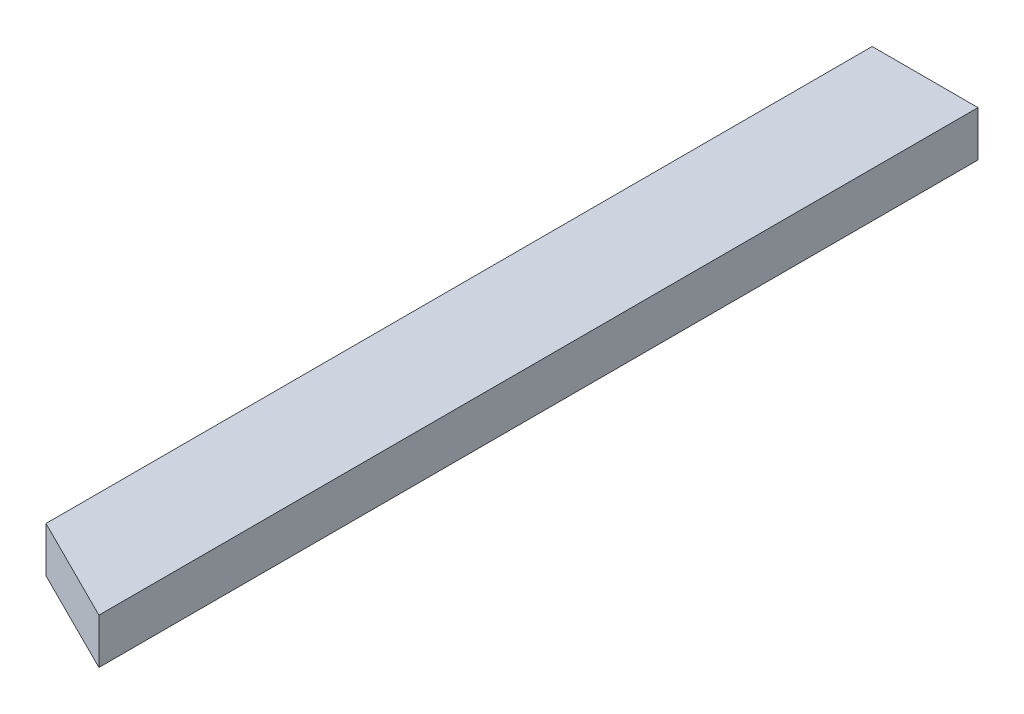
from build123d import *

# Parameters (mm, degrees)
BOSS_EXTRUDE1_DEPTH = 38.1


with BuildPart() as part:
    # Sketch1 → Boss-Extrude1 (new body)
    with BuildSketch(Plane(origin=(0, 0, 0), x_dir=(1, 0, 0), z_dir=(0, 1, 0))):
        Polygon((0, 0), (0, -738.378), (-88.9, -693.918401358), (-88.9, 0), align=None)
    extrude(amount=BOSS_EXTRUDE1_DEPTH)


solid = part.part
